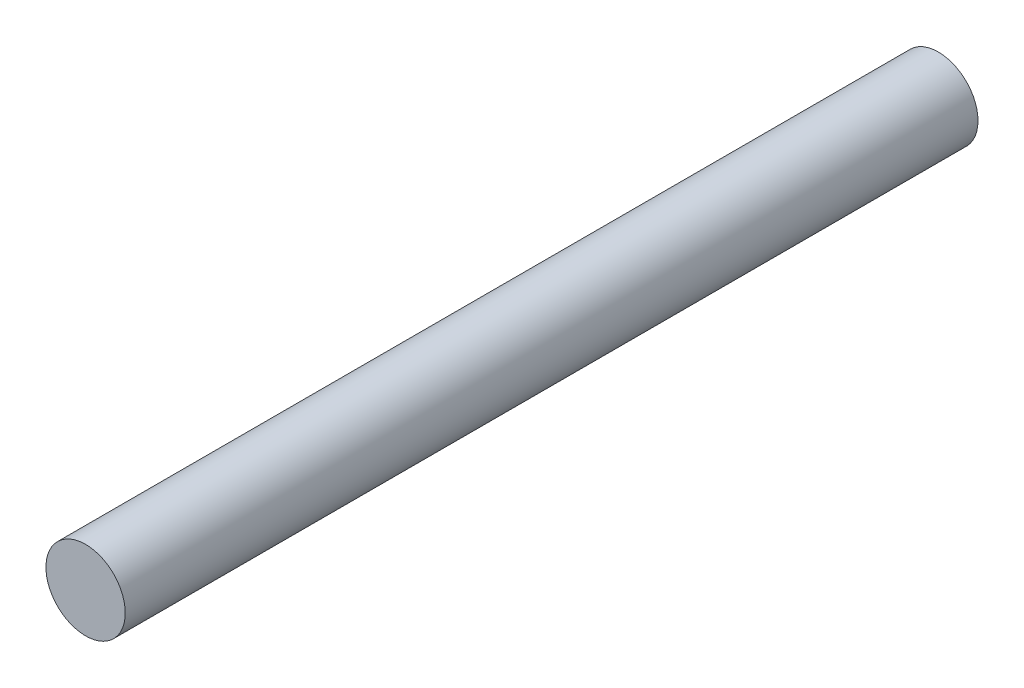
from build123d import *

# Parameters (mm, degrees)
SKETCH_1_R      = 2
EXTRUDE_1_DEPTH = 21.5


with BuildPart() as part:
    # Sketch 1 → Extrude 1 (new, symmetric)
    with BuildSketch(Plane.XY):
        Circle(SKETCH_1_R)
    extrude(amount=EXTRUDE_1_DEPTH, both=True)


solid = part.part
